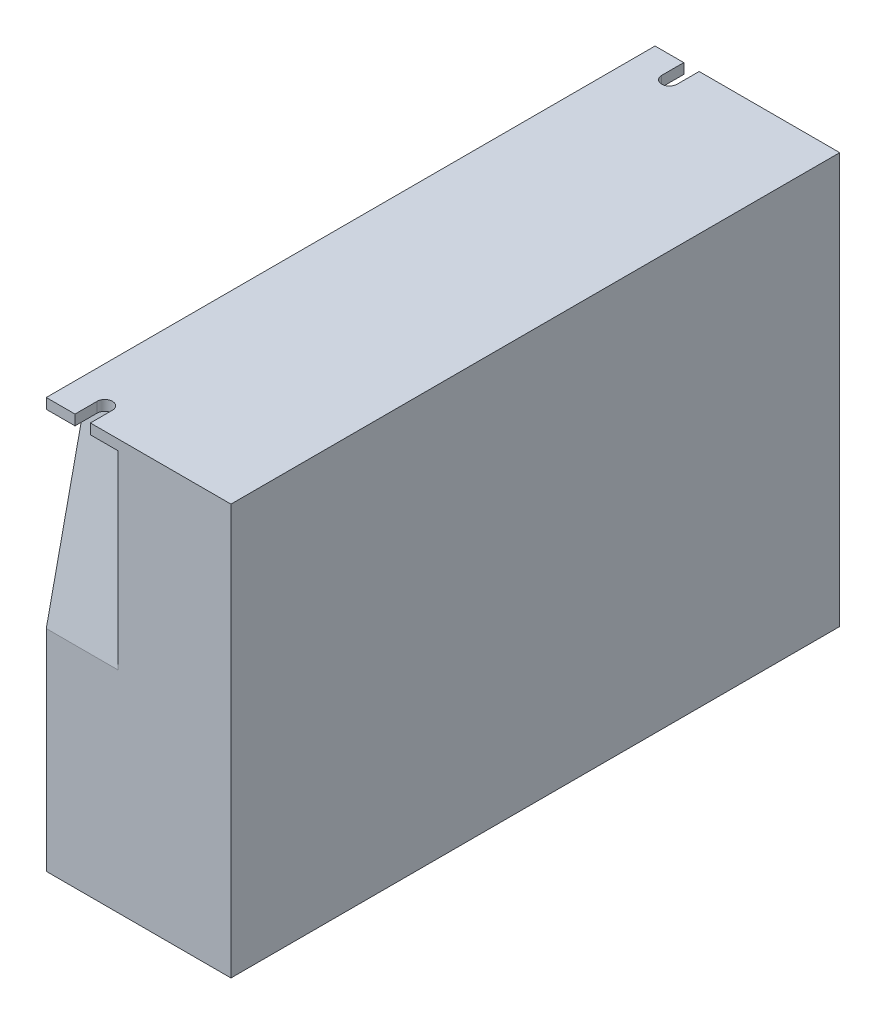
ISO-10303-21;
HEADER;
FILE_DESCRIPTION(('STEP AP214'),'2;1');
FILE_NAME('part.step','',(''),(''),'','','');
FILE_SCHEMA(('AUTOMOTIVE_DESIGN { 1 0 10303 214 1 1 1 1 }'));
ENDSEC;
DATA;
#1=APPLICATION_CONTEXT('core data for automotive mechanical design processes');
#2=APPLICATION_PROTOCOL_DEFINITION('international standard','automotive_design',2000,#1);
#3=PRODUCT_CONTEXT('',#1,'mechanical');
#4=PRODUCT('Part','Part','',(#3));
#5=PRODUCT_RELATED_PRODUCT_CATEGORY('part','',(#4));
#6=PRODUCT_DEFINITION_FORMATION('','',#4);
#7=PRODUCT_DEFINITION_CONTEXT('part definition',#1,'design');
#8=PRODUCT_DEFINITION('design','',#6,#7);
#9=PRODUCT_DEFINITION_SHAPE('','',#8);
#10=(LENGTH_UNIT() NAMED_UNIT(*) SI_UNIT(.MILLI.,.METRE.));
#11=(NAMED_UNIT(*) PLANE_ANGLE_UNIT() SI_UNIT($,.RADIAN.));
#12=(NAMED_UNIT(*) SI_UNIT($,.STERADIAN.) SOLID_ANGLE_UNIT());
#13=UNCERTAINTY_MEASURE_WITH_UNIT(LENGTH_MEASURE(1.E-05),#10,'distance_accuracy_value','');
#14=(GEOMETRIC_REPRESENTATION_CONTEXT(3) GLOBAL_UNCERTAINTY_ASSIGNED_CONTEXT((#13)) GLOBAL_UNIT_ASSIGNED_CONTEXT((#10,
#11,#12)) REPRESENTATION_CONTEXT('',''));
#15=CARTESIAN_POINT('',(0.,0.,0.));
#16=DIRECTION('',(0.,0.,1.));
#17=DIRECTION('',(1.,0.,0.));
#18=AXIS2_PLACEMENT_3D('',#15,#16,#17);
#19=CARTESIAN_POINT('',(54.,-60.,89.));
#20=DIRECTION('',(0.,0.,-1.));
#21=DIRECTION('',(-1.,0.,0.));
#22=AXIS2_PLACEMENT_3D('',#19,#20,#21);
#23=PLANE('',#22);
#24=DIRECTION('',(-1.,0.,0.));
#25=VECTOR('',#24,1.);
#26=CARTESIAN_POINT('',(54.,60.,89.));
#27=LINE('',#26,#25);
#28=CARTESIAN_POINT('',(54.,60.,89.));
#29=VERTEX_POINT('',#28);
#30=CARTESIAN_POINT('',(12.9,60.,89.));
#31=VERTEX_POINT('',#30);
#32=EDGE_CURVE('E289',#29,#31,#27,.T.);
#33=ORIENTED_EDGE('',*,*,#32,.T.);
#34=DIRECTION('',(0.,1.,0.));
#35=VECTOR('',#34,1.);
#36=CARTESIAN_POINT('',(12.9,57.,89.));
#37=LINE('',#36,#35);
#38=CARTESIAN_POINT('',(12.9,57.,89.));
#39=VERTEX_POINT('',#38);
#40=EDGE_CURVE('E191',#39,#31,#37,.T.);
#41=ORIENTED_EDGE('',*,*,#40,.F.);
#42=DIRECTION('',(-1.,0.,0.));
#43=VECTOR('',#42,1.);
#44=CARTESIAN_POINT('',(21.,57.,89.));
#45=LINE('',#44,#43);
#46=CARTESIAN_POINT('',(21.,57.,89.));
#47=VERTEX_POINT('',#46);
#48=EDGE_CURVE('E230',#47,#39,#45,.T.);
#49=ORIENTED_EDGE('',*,*,#48,.F.);
#50=DIRECTION('',(0.,1.,0.));
#51=VECTOR('',#50,1.);
#52=CARTESIAN_POINT('',(21.,57.,89.));
#53=LINE('',#52,#51);
#54=CARTESIAN_POINT('',(21.,1.49999999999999,89.));
#55=VERTEX_POINT('',#54);
#56=EDGE_CURVE('E224',#55,#47,#53,.T.);
#57=ORIENTED_EDGE('',*,*,#56,.F.);
#58=DIRECTION('',(-1.,0.,0.));
#59=VECTOR('',#58,1.);
#60=CARTESIAN_POINT('',(21.,1.49999999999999,89.));
#61=LINE('',#60,#59);
#62=CARTESIAN_POINT('',(0.,1.49999999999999,89.));
#63=VERTEX_POINT('',#62);
#64=EDGE_CURVE('E234',#55,#63,#61,.T.);
#65=ORIENTED_EDGE('',*,*,#64,.T.);
#66=DIRECTION('',(0.,-1.,0.));
#67=VECTOR('',#66,1.);
#68=CARTESIAN_POINT('',(0.,-60.,89.));
#69=LINE('',#68,#67);
#70=CARTESIAN_POINT('',(0.,-60.,89.));
#71=VERTEX_POINT('',#70);
#72=EDGE_CURVE('E279',#63,#71,#69,.T.);
#73=ORIENTED_EDGE('',*,*,#72,.T.);
#74=DIRECTION('',(-1.,0.,0.));
#75=VECTOR('',#74,1.);
#76=CARTESIAN_POINT('',(54.,-60.,89.));
#77=LINE('',#76,#75);
#78=CARTESIAN_POINT('',(54.,-60.,89.));
#79=VERTEX_POINT('',#78);
#80=EDGE_CURVE('E286',#79,#71,#77,.T.);
#81=ORIENTED_EDGE('',*,*,#80,.F.);
#82=DIRECTION('',(0.,-1.,0.));
#83=VECTOR('',#82,1.);
#84=CARTESIAN_POINT('',(54.,-60.,89.));
#85=LINE('',#84,#83);
#86=EDGE_CURVE('E268',#29,#79,#85,.T.);
#87=ORIENTED_EDGE('',*,*,#86,.F.);
#88=EDGE_LOOP('',(#33,#41,#49,#57,#65,#73,#81,#87));
#89=FACE_BOUND('',#88,.T.);
#90=ADVANCED_FACE('F35',(#89),#23,.F.);
#91=CARTESIAN_POINT('',(54.,-60.,-89.));
#92=DIRECTION('',(0.,0.,1.));
#93=DIRECTION('',(1.,0.,0.));
#94=AXIS2_PLACEMENT_3D('',#91,#92,#93);
#95=PLANE('',#94);
#96=DIRECTION('',(-1.,0.,0.));
#97=VECTOR('',#96,1.);
#98=CARTESIAN_POINT('',(54.,60.,-89.));
#99=LINE('',#98,#97);
#100=CARTESIAN_POINT('',(8.4,60.,-89.));
#101=VERTEX_POINT('',#100);
#102=CARTESIAN_POINT('',(0.,60.,-89.));
#103=VERTEX_POINT('',#102);
#104=EDGE_CURVE('E43',#101,#103,#99,.T.);
#105=ORIENTED_EDGE('',*,*,#104,.F.);
#106=DIRECTION('',(0.,1.,0.));
#107=VECTOR('',#106,1.);
#108=CARTESIAN_POINT('',(8.4,57.,-89.));
#109=LINE('',#108,#107);
#110=CARTESIAN_POINT('',(8.4,57.,-89.));
#111=VERTEX_POINT('',#110);
#112=EDGE_CURVE('E213',#111,#101,#109,.T.);
#113=ORIENTED_EDGE('',*,*,#112,.F.);
#114=DIRECTION('',(-1.,0.,0.));
#115=VECTOR('',#114,1.);
#116=CARTESIAN_POINT('',(21.,57.,-89.));
#117=LINE('',#116,#115);
#118=CARTESIAN_POINT('',(0.,57.,-89.));
#119=VERTEX_POINT('',#118);
#120=EDGE_CURVE('E258',#111,#119,#117,.T.);
#121=ORIENTED_EDGE('',*,*,#120,.T.);
#122=DIRECTION('',(0.,1.,0.));
#123=VECTOR('',#122,1.);
#124=CARTESIAN_POINT('',(0.,-60.,-89.));
#125=LINE('',#124,#123);
#126=EDGE_CURVE('E257',#119,#103,#125,.T.);
#127=ORIENTED_EDGE('',*,*,#126,.T.);
#128=EDGE_LOOP('',(#105,#113,#121,#127));
#129=FACE_BOUND('',#128,.T.);
#130=ADVANCED_FACE('F339',(#129),#95,.F.);
#131=CARTESIAN_POINT('',(21.,57.,-89.));
#132=VERTEX_POINT('',#131);
#133=CARTESIAN_POINT('',(12.9,57.,-89.));
#134=VERTEX_POINT('',#133);
#135=EDGE_CURVE('E254',#132,#134,#117,.T.);
#136=ORIENTED_EDGE('',*,*,#135,.T.);
#137=DIRECTION('',(0.,1.,0.));
#138=VECTOR('',#137,1.);
#139=CARTESIAN_POINT('',(12.9,57.,-89.));
#140=LINE('',#139,#138);
#141=CARTESIAN_POINT('',(12.9,60.,-89.));
#142=VERTEX_POINT('',#141);
#143=EDGE_CURVE('E58',#134,#142,#140,.T.);
#144=ORIENTED_EDGE('',*,*,#143,.T.);
#145=CARTESIAN_POINT('',(54.,60.,-89.));
#146=VERTEX_POINT('',#145);
#147=EDGE_CURVE('E11',#146,#142,#99,.T.);
#148=ORIENTED_EDGE('',*,*,#147,.F.);
#149=DIRECTION('',(0.,1.,0.));
#150=VECTOR('',#149,1.);
#151=CARTESIAN_POINT('',(54.,-60.,-89.));
#152=LINE('',#151,#150);
#153=CARTESIAN_POINT('',(54.,-60.,-89.));
#154=VERTEX_POINT('',#153);
#155=EDGE_CURVE('E262',#154,#146,#152,.T.);
#156=ORIENTED_EDGE('',*,*,#155,.F.);
#157=DIRECTION('',(-1.,0.,0.));
#158=VECTOR('',#157,1.);
#159=CARTESIAN_POINT('',(54.,-60.,-89.));
#160=LINE('',#159,#158);
#161=CARTESIAN_POINT('',(0.,-60.,-89.));
#162=VERTEX_POINT('',#161);
#163=EDGE_CURVE('E272',#154,#162,#160,.T.);
#164=ORIENTED_EDGE('',*,*,#163,.T.);
#165=CARTESIAN_POINT('',(0.,1.49999999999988,-89.));
#166=VERTEX_POINT('',#165);
#167=EDGE_CURVE('E273',#162,#166,#125,.T.);
#168=ORIENTED_EDGE('',*,*,#167,.T.);
#169=DIRECTION('',(-1.,0.,0.));
#170=VECTOR('',#169,1.);
#171=CARTESIAN_POINT('',(21.,1.49999999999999,-89.));
#172=LINE('',#171,#170);
#173=CARTESIAN_POINT('',(21.,1.49999999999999,-89.));
#174=VERTEX_POINT('',#173);
#175=EDGE_CURVE('E249',#174,#166,#172,.T.);
#176=ORIENTED_EDGE('',*,*,#175,.F.);
#177=DIRECTION('',(0.,-1.,0.));
#178=VECTOR('',#177,1.);
#179=CARTESIAN_POINT('',(21.,57.,-89.));
#180=LINE('',#179,#178);
#181=EDGE_CURVE('E239',#132,#174,#180,.T.);
#182=ORIENTED_EDGE('',*,*,#181,.F.);
#183=EDGE_LOOP('',(#136,#144,#148,#156,#164,#168,#176,#182));
#184=FACE_BOUND('',#183,.T.);
#185=ADVANCED_FACE('F37',(#184),#95,.F.);
#186=CARTESIAN_POINT('',(54.,60.,89.));
#187=DIRECTION('',(0.,-1.,0.));
#188=DIRECTION('',(0.,0.,-1.));
#189=AXIS2_PLACEMENT_3D('',#186,#187,#188);
#190=PLANE('',#189);
#191=CARTESIAN_POINT('',(10.65,60.,82.55));
#192=DIRECTION('',(0.,1.,0.));
#193=DIRECTION('',(0.,0.,1.));
#194=AXIS2_PLACEMENT_3D('',#191,#192,#193);
#195=CIRCLE('',#194,2.25);
#196=CARTESIAN_POINT('',(12.9,60.,82.55));
#197=VERTEX_POINT('',#196);
#198=CARTESIAN_POINT('',(8.4,60.,82.55));
#199=VERTEX_POINT('',#198);
#200=EDGE_CURVE('E168',#197,#199,#195,.T.);
#201=ORIENTED_EDGE('',*,*,#200,.F.);
#202=DIRECTION('',(0.,0.,-1.));
#203=VECTOR('',#202,1.);
#204=CARTESIAN_POINT('',(12.9,60.,89.));
#205=LINE('',#204,#203);
#206=EDGE_CURVE('E179',#31,#197,#205,.T.);
#207=ORIENTED_EDGE('',*,*,#206,.F.);
#208=ORIENTED_EDGE('',*,*,#32,.F.);
#209=DIRECTION('',(0.,0.,1.));
#210=VECTOR('',#209,1.);
#211=CARTESIAN_POINT('',(54.,60.,89.));
#212=LINE('',#211,#210);
#213=EDGE_CURVE('E265',#146,#29,#212,.T.);
#214=ORIENTED_EDGE('',*,*,#213,.F.);
#215=ORIENTED_EDGE('',*,*,#147,.T.);
#216=DIRECTION('',(0.,0.,-1.));
#217=VECTOR('',#216,1.);
#218=CARTESIAN_POINT('',(12.9,60.,-89.));
#219=LINE('',#218,#217);
#220=CARTESIAN_POINT('',(12.9,60.,-82.55));
#221=VERTEX_POINT('',#220);
#222=EDGE_CURVE('E206',#221,#142,#219,.T.);
#223=ORIENTED_EDGE('',*,*,#222,.F.);
#224=CARTESIAN_POINT('',(10.65,60.,-82.55));
#225=DIRECTION('',(0.,1.,0.));
#226=DIRECTION('',(0.,0.,1.));
#227=AXIS2_PLACEMENT_3D('',#224,#225,#226);
#228=CIRCLE('',#227,2.25);
#229=CARTESIAN_POINT('',(8.4,60.,-82.55));
#230=VERTEX_POINT('',#229);
#231=EDGE_CURVE('E190',#230,#221,#228,.T.);
#232=ORIENTED_EDGE('',*,*,#231,.F.);
#233=DIRECTION('',(0.,0.,1.));
#234=VECTOR('',#233,1.);
#235=CARTESIAN_POINT('',(8.4,60.,-82.55));
#236=LINE('',#235,#234);
#237=EDGE_CURVE('E198',#101,#230,#236,.T.);
#238=ORIENTED_EDGE('',*,*,#237,.F.);
#239=ORIENTED_EDGE('',*,*,#104,.T.);
#240=DIRECTION('',(0.,0.,1.));
#241=VECTOR('',#240,1.);
#242=CARTESIAN_POINT('',(0.,60.,89.));
#243=LINE('',#242,#241);
#244=CARTESIAN_POINT('',(0.,60.,89.));
#245=VERTEX_POINT('',#244);
#246=EDGE_CURVE('E276',#103,#245,#243,.T.);
#247=ORIENTED_EDGE('',*,*,#246,.T.);
#248=CARTESIAN_POINT('',(8.4,60.,89.));
#249=VERTEX_POINT('',#248);
#250=EDGE_CURVE('E288',#249,#245,#27,.T.);
#251=ORIENTED_EDGE('',*,*,#250,.F.);
#252=DIRECTION('',(0.,0.,1.));
#253=VECTOR('',#252,1.);
#254=CARTESIAN_POINT('',(8.4,60.,82.55));
#255=LINE('',#254,#253);
#256=EDGE_CURVE('E182',#199,#249,#255,.T.);
#257=ORIENTED_EDGE('',*,*,#256,.F.);
#258=EDGE_LOOP('',(#201,#207,#208,#214,#215,#223,#232,#238,#239,#247,#251,#257));
#259=FACE_BOUND('',#258,.T.);
#260=ADVANCED_FACE('F301',(#259),#190,.F.);
#261=CARTESIAN_POINT('',(8.4,57.,89.));
#262=VERTEX_POINT('',#261);
#263=CARTESIAN_POINT('',(0.,57.,89.));
#264=VERTEX_POINT('',#263);
#265=EDGE_CURVE('E233',#262,#264,#45,.T.);
#266=ORIENTED_EDGE('',*,*,#265,.F.);
#267=DIRECTION('',(0.,1.,0.));
#268=VECTOR('',#267,1.);
#269=CARTESIAN_POINT('',(8.4,57.,89.));
#270=LINE('',#269,#268);
#271=EDGE_CURVE('E50',#262,#249,#270,.T.);
#272=ORIENTED_EDGE('',*,*,#271,.T.);
#273=ORIENTED_EDGE('',*,*,#250,.T.);
#274=EDGE_CURVE('E280',#245,#264,#69,.T.);
#275=ORIENTED_EDGE('',*,*,#274,.T.);
#276=EDGE_LOOP('',(#266,#272,#273,#275));
#277=FACE_BOUND('',#276,.T.);
#278=ADVANCED_FACE('F297',(#277),#23,.F.);
#279=CARTESIAN_POINT('',(54.,-60.,89.));
#280=DIRECTION('',(0.,1.,0.));
#281=DIRECTION('',(0.,0.,1.));
#282=AXIS2_PLACEMENT_3D('',#279,#280,#281);
#283=PLANE('',#282);
#284=DIRECTION('',(0.,0.,-1.));
#285=VECTOR('',#284,1.);
#286=CARTESIAN_POINT('',(0.,-60.,89.));
#287=LINE('',#286,#285);
#288=EDGE_CURVE('E266',#71,#162,#287,.T.);
#289=ORIENTED_EDGE('',*,*,#288,.T.);
#290=ORIENTED_EDGE('',*,*,#163,.F.);
#291=DIRECTION('',(0.,0.,-1.));
#292=VECTOR('',#291,1.);
#293=CARTESIAN_POINT('',(54.,-60.,89.));
#294=LINE('',#293,#292);
#295=EDGE_CURVE('E270',#79,#154,#294,.T.);
#296=ORIENTED_EDGE('',*,*,#295,.F.);
#297=ORIENTED_EDGE('',*,*,#80,.T.);
#298=EDGE_LOOP('',(#289,#290,#296,#297));
#299=FACE_BOUND('',#298,.T.);
#300=ADVANCED_FACE('F353',(#299),#283,.F.);
#301=CARTESIAN_POINT('',(54.,0.,0.));
#302=DIRECTION('',(-1.,0.,0.));
#303=DIRECTION('',(0.,0.,1.));
#304=AXIS2_PLACEMENT_3D('',#301,#302,#303);
#305=PLANE('',#304);
#306=ORIENTED_EDGE('',*,*,#155,.T.);
#307=ORIENTED_EDGE('',*,*,#213,.T.);
#308=ORIENTED_EDGE('',*,*,#86,.T.);
#309=ORIENTED_EDGE('',*,*,#295,.T.);
#310=EDGE_LOOP('',(#306,#307,#308,#309));
#311=FACE_BOUND('',#310,.T.);
#312=ADVANCED_FACE('F324',(#311),#305,.F.);
#313=CARTESIAN_POINT('',(0.,0.,0.));
#314=DIRECTION('',(-1.,0.,0.));
#315=DIRECTION('',(0.,0.,1.));
#316=AXIS2_PLACEMENT_3D('',#313,#314,#315);
#317=PLANE('',#316);
#318=DIRECTION('',(0.,0.,-1.));
#319=VECTOR('',#318,1.);
#320=CARTESIAN_POINT('',(0.,57.,89.));
#321=LINE('',#320,#319);
#322=CARTESIAN_POINT('',(0.,57.,77.));
#323=VERTEX_POINT('',#322);
#324=EDGE_CURVE('E212',#264,#323,#321,.T.);
#325=ORIENTED_EDGE('',*,*,#324,.F.);
#326=ORIENTED_EDGE('',*,*,#274,.F.);
#327=ORIENTED_EDGE('',*,*,#246,.F.);
#328=ORIENTED_EDGE('',*,*,#126,.F.);
#329=DIRECTION('',(0.,0.,-1.));
#330=VECTOR('',#329,1.);
#331=CARTESIAN_POINT('',(0.,57.,-89.));
#332=LINE('',#331,#330);
#333=CARTESIAN_POINT('',(0.,57.,-77.));
#334=VERTEX_POINT('',#333);
#335=EDGE_CURVE('E243',#334,#119,#332,.T.);
#336=ORIENTED_EDGE('',*,*,#335,.F.);
#337=DIRECTION('',(0.,0.977414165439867,0.211332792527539));
#338=VECTOR('',#337,1.);
#339=CARTESIAN_POINT('',(0.,57.,-77.));
#340=LINE('',#339,#338);
#341=EDGE_CURVE('E232',#166,#334,#340,.T.);
#342=ORIENTED_EDGE('',*,*,#341,.F.);
#343=ORIENTED_EDGE('',*,*,#167,.F.);
#344=ORIENTED_EDGE('',*,*,#288,.F.);
#345=ORIENTED_EDGE('',*,*,#72,.F.);
#346=DIRECTION('',(0.,-0.977414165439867,0.211332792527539));
#347=VECTOR('',#346,1.);
#348=CARTESIAN_POINT('',(0.,57.,77.));
#349=LINE('',#348,#347);
#350=EDGE_CURVE('E221',#323,#63,#349,.T.);
#351=ORIENTED_EDGE('',*,*,#350,.F.);
#352=EDGE_LOOP('',(#325,#326,#327,#328,#336,#342,#343,#344,#345,#351));
#353=FACE_BOUND('',#352,.T.);
#354=ADVANCED_FACE('F308',(#353),#317,.T.);
#355=CARTESIAN_POINT('',(21.,57.,-89.));
#356=DIRECTION('',(0.,1.,0.));
#357=DIRECTION('',(0.,0.,1.));
#358=AXIS2_PLACEMENT_3D('',#355,#356,#357);
#359=PLANE('',#358);
#360=ORIENTED_EDGE('',*,*,#120,.F.);
#361=DIRECTION('',(0.,0.,1.));
#362=VECTOR('',#361,1.);
#363=CARTESIAN_POINT('',(8.4,57.,-82.55));
#364=LINE('',#363,#362);
#365=CARTESIAN_POINT('',(8.4,57.,-82.55));
#366=VERTEX_POINT('',#365);
#367=EDGE_CURVE('E200',#111,#366,#364,.T.);
#368=ORIENTED_EDGE('',*,*,#367,.T.);
#369=CARTESIAN_POINT('',(10.65,57.,-82.55));
#370=DIRECTION('',(0.,1.,0.));
#371=DIRECTION('',(0.,0.,1.));
#372=AXIS2_PLACEMENT_3D('',#369,#370,#371);
#373=CIRCLE('',#372,2.25);
#374=CARTESIAN_POINT('',(12.9,57.,-82.55));
#375=VERTEX_POINT('',#374);
#376=EDGE_CURVE('E194',#366,#375,#373,.T.);
#377=ORIENTED_EDGE('',*,*,#376,.T.);
#378=DIRECTION('',(0.,0.,-1.));
#379=VECTOR('',#378,1.);
#380=CARTESIAN_POINT('',(12.9,57.,-89.));
#381=LINE('',#380,#379);
#382=EDGE_CURVE('E197',#375,#134,#381,.T.);
#383=ORIENTED_EDGE('',*,*,#382,.T.);
#384=ORIENTED_EDGE('',*,*,#135,.F.);
#385=DIRECTION('',(0.,0.,-1.));
#386=VECTOR('',#385,1.);
#387=CARTESIAN_POINT('',(21.,57.,-89.));
#388=LINE('',#387,#386);
#389=CARTESIAN_POINT('',(21.,57.,-77.));
#390=VERTEX_POINT('',#389);
#391=EDGE_CURVE('E246',#390,#132,#388,.T.);
#392=ORIENTED_EDGE('',*,*,#391,.F.);
#393=DIRECTION('',(-1.,0.,0.));
#394=VECTOR('',#393,1.);
#395=CARTESIAN_POINT('',(21.,57.,-77.));
#396=LINE('',#395,#394);
#397=EDGE_CURVE('E259',#390,#334,#396,.T.);
#398=ORIENTED_EDGE('',*,*,#397,.T.);
#399=ORIENTED_EDGE('',*,*,#335,.T.);
#400=EDGE_LOOP('',(#360,#368,#377,#383,#384,#392,#398,#399));
#401=FACE_BOUND('',#400,.T.);
#402=ADVANCED_FACE('F345',(#401),#359,.F.);
#403=CARTESIAN_POINT('',(21.,57.,-77.));
#404=DIRECTION('',(0.,-0.211332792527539,0.977414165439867));
#405=DIRECTION('',(0.,-0.977414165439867,-0.211332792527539));
#406=AXIS2_PLACEMENT_3D('',#403,#404,#405);
#407=PLANE('',#406);
#408=ORIENTED_EDGE('',*,*,#341,.T.);
#409=ORIENTED_EDGE('',*,*,#397,.F.);
#410=DIRECTION('',(0.,0.977414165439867,0.211332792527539));
#411=VECTOR('',#410,1.);
#412=CARTESIAN_POINT('',(21.,57.,-77.));
#413=LINE('',#412,#411);
#414=EDGE_CURVE('E242',#174,#390,#413,.T.);
#415=ORIENTED_EDGE('',*,*,#414,.F.);
#416=ORIENTED_EDGE('',*,*,#175,.T.);
#417=EDGE_LOOP('',(#408,#409,#415,#416));
#418=FACE_BOUND('',#417,.T.);
#419=ADVANCED_FACE('F348',(#418),#407,.F.);
#420=CARTESIAN_POINT('',(21.,0.,0.));
#421=DIRECTION('',(-1.,0.,0.));
#422=DIRECTION('',(0.,0.,1.));
#423=AXIS2_PLACEMENT_3D('',#420,#421,#422);
#424=PLANE('',#423);
#425=ORIENTED_EDGE('',*,*,#181,.T.);
#426=ORIENTED_EDGE('',*,*,#414,.T.);
#427=ORIENTED_EDGE('',*,*,#391,.T.);
#428=EDGE_LOOP('',(#425,#426,#427));
#429=FACE_BOUND('',#428,.T.);
#430=ADVANCED_FACE('F406',(#429),#424,.T.);
#431=CARTESIAN_POINT('',(21.,57.,89.));
#432=DIRECTION('',(0.,1.,0.));
#433=DIRECTION('',(0.,0.,1.));
#434=AXIS2_PLACEMENT_3D('',#431,#432,#433);
#435=PLANE('',#434);
#436=ORIENTED_EDGE('',*,*,#48,.T.);
#437=DIRECTION('',(0.,0.,-1.));
#438=VECTOR('',#437,1.);
#439=CARTESIAN_POINT('',(12.9,57.,89.));
#440=LINE('',#439,#438);
#441=CARTESIAN_POINT('',(12.9,57.,82.55));
#442=VERTEX_POINT('',#441);
#443=EDGE_CURVE('E170',#39,#442,#440,.T.);
#444=ORIENTED_EDGE('',*,*,#443,.T.);
#445=CARTESIAN_POINT('',(10.65,57.,82.55));
#446=DIRECTION('',(0.,1.,0.));
#447=DIRECTION('',(0.,0.,1.));
#448=AXIS2_PLACEMENT_3D('',#445,#446,#447);
#449=CIRCLE('',#448,2.25);
#450=CARTESIAN_POINT('',(8.4,57.,82.55));
#451=VERTEX_POINT('',#450);
#452=EDGE_CURVE('E165',#442,#451,#449,.T.);
#453=ORIENTED_EDGE('',*,*,#452,.T.);
#454=DIRECTION('',(0.,0.,1.));
#455=VECTOR('',#454,1.);
#456=CARTESIAN_POINT('',(8.4,57.,82.55));
#457=LINE('',#456,#455);
#458=EDGE_CURVE('E172',#451,#262,#457,.T.);
#459=ORIENTED_EDGE('',*,*,#458,.T.);
#460=ORIENTED_EDGE('',*,*,#265,.T.);
#461=ORIENTED_EDGE('',*,*,#324,.T.);
#462=DIRECTION('',(-1.,0.,0.));
#463=VECTOR('',#462,1.);
#464=CARTESIAN_POINT('',(21.,57.,77.));
#465=LINE('',#464,#463);
#466=CARTESIAN_POINT('',(21.,57.,77.));
#467=VERTEX_POINT('',#466);
#468=EDGE_CURVE('E227',#467,#323,#465,.T.);
#469=ORIENTED_EDGE('',*,*,#468,.F.);
#470=DIRECTION('',(0.,0.,-1.));
#471=VECTOR('',#470,1.);
#472=CARTESIAN_POINT('',(21.,57.,89.));
#473=LINE('',#472,#471);
#474=EDGE_CURVE('E217',#47,#467,#473,.T.);
#475=ORIENTED_EDGE('',*,*,#474,.F.);
#476=EDGE_LOOP('',(#436,#444,#453,#459,#460,#461,#469,#475));
#477=FACE_BOUND('',#476,.T.);
#478=ADVANCED_FACE('F178',(#477),#435,.F.);
#479=CARTESIAN_POINT('',(21.,57.,77.));
#480=DIRECTION('',(0.,-0.211332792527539,-0.977414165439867));
#481=DIRECTION('',(0.,0.977414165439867,-0.211332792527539));
#482=AXIS2_PLACEMENT_3D('',#479,#480,#481);
#483=PLANE('',#482);
#484=ORIENTED_EDGE('',*,*,#350,.T.);
#485=ORIENTED_EDGE('',*,*,#64,.F.);
#486=DIRECTION('',(0.,-0.977414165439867,0.211332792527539));
#487=VECTOR('',#486,1.);
#488=CARTESIAN_POINT('',(21.,57.,77.));
#489=LINE('',#488,#487);
#490=EDGE_CURVE('E220',#467,#55,#489,.T.);
#491=ORIENTED_EDGE('',*,*,#490,.F.);
#492=ORIENTED_EDGE('',*,*,#468,.T.);
#493=EDGE_LOOP('',(#484,#485,#491,#492));
#494=FACE_BOUND('',#493,.T.);
#495=ADVANCED_FACE('F313',(#494),#483,.F.);
#496=CARTESIAN_POINT('',(21.,0.,0.));
#497=DIRECTION('',(-1.,0.,0.));
#498=DIRECTION('',(0.,0.,1.));
#499=AXIS2_PLACEMENT_3D('',#496,#497,#498);
#500=PLANE('',#499);
#501=ORIENTED_EDGE('',*,*,#474,.T.);
#502=ORIENTED_EDGE('',*,*,#490,.T.);
#503=ORIENTED_EDGE('',*,*,#56,.T.);
#504=EDGE_LOOP('',(#501,#502,#503));
#505=FACE_BOUND('',#504,.T.);
#506=ADVANCED_FACE('F316',(#505),#500,.T.);
#507=CARTESIAN_POINT('',(10.65,57.,-82.55));
#508=DIRECTION('',(0.,1.,0.));
#509=DIRECTION('',(0.,0.,1.));
#510=AXIS2_PLACEMENT_3D('',#507,#508,#509);
#511=CYLINDRICAL_SURFACE('',#510,2.25);
#512=ORIENTED_EDGE('',*,*,#231,.T.);
#513=DIRECTION('',(0.,1.,0.));
#514=VECTOR('',#513,1.);
#515=CARTESIAN_POINT('',(12.9,57.,-82.55));
#516=LINE('',#515,#514);
#517=EDGE_CURVE('E203',#375,#221,#516,.T.);
#518=ORIENTED_EDGE('',*,*,#517,.F.);
#519=ORIENTED_EDGE('',*,*,#376,.F.);
#520=DIRECTION('',(0.,1.,0.));
#521=VECTOR('',#520,1.);
#522=CARTESIAN_POINT('',(8.4,57.,-82.55));
#523=LINE('',#522,#521);
#524=EDGE_CURVE('E210',#366,#230,#523,.T.);
#525=ORIENTED_EDGE('',*,*,#524,.T.);
#526=EDGE_LOOP('',(#512,#518,#519,#525));
#527=FACE_BOUND('',#526,.T.);
#528=ADVANCED_FACE('F334',(#527),#511,.F.);
#529=CARTESIAN_POINT('',(8.4,57.,-82.55));
#530=DIRECTION('',(-1.,0.,0.));
#531=DIRECTION('',(0.,0.,1.));
#532=AXIS2_PLACEMENT_3D('',#529,#530,#531);
#533=PLANE('',#532);
#534=ORIENTED_EDGE('',*,*,#237,.T.);
#535=ORIENTED_EDGE('',*,*,#524,.F.);
#536=ORIENTED_EDGE('',*,*,#367,.F.);
#537=ORIENTED_EDGE('',*,*,#112,.T.);
#538=EDGE_LOOP('',(#534,#535,#536,#537));
#539=FACE_BOUND('',#538,.T.);
#540=ADVANCED_FACE('F336',(#539),#533,.F.);
#541=CARTESIAN_POINT('',(12.9,57.,-89.));
#542=DIRECTION('',(1.,0.,0.));
#543=DIRECTION('',(0.,0.,-1.));
#544=AXIS2_PLACEMENT_3D('',#541,#542,#543);
#545=PLANE('',#544);
#546=ORIENTED_EDGE('',*,*,#222,.T.);
#547=ORIENTED_EDGE('',*,*,#143,.F.);
#548=ORIENTED_EDGE('',*,*,#382,.F.);
#549=ORIENTED_EDGE('',*,*,#517,.T.);
#550=EDGE_LOOP('',(#546,#547,#548,#549));
#551=FACE_BOUND('',#550,.T.);
#552=ADVANCED_FACE('F331',(#551),#545,.F.);
#553=CARTESIAN_POINT('',(10.65,57.,82.55));
#554=DIRECTION('',(0.,1.,0.));
#555=DIRECTION('',(0.,0.,1.));
#556=AXIS2_PLACEMENT_3D('',#553,#554,#555);
#557=CYLINDRICAL_SURFACE('',#556,2.25);
#558=ORIENTED_EDGE('',*,*,#200,.T.);
#559=DIRECTION('',(0.,1.,0.));
#560=VECTOR('',#559,1.);
#561=CARTESIAN_POINT('',(8.4,57.,82.55));
#562=LINE('',#561,#560);
#563=EDGE_CURVE('E162',#451,#199,#562,.T.);
#564=ORIENTED_EDGE('',*,*,#563,.F.);
#565=ORIENTED_EDGE('',*,*,#452,.F.);
#566=DIRECTION('',(0.,1.,0.));
#567=VECTOR('',#566,1.);
#568=CARTESIAN_POINT('',(12.9,57.,82.55));
#569=LINE('',#568,#567);
#570=EDGE_CURVE('E188',#442,#197,#569,.T.);
#571=ORIENTED_EDGE('',*,*,#570,.T.);
#572=EDGE_LOOP('',(#558,#564,#565,#571));
#573=FACE_BOUND('',#572,.T.);
#574=ADVANCED_FACE('F163',(#573),#557,.F.);
#575=CARTESIAN_POINT('',(12.9,57.,89.));
#576=DIRECTION('',(1.,0.,0.));
#577=DIRECTION('',(0.,0.,-1.));
#578=AXIS2_PLACEMENT_3D('',#575,#576,#577);
#579=PLANE('',#578);
#580=ORIENTED_EDGE('',*,*,#206,.T.);
#581=ORIENTED_EDGE('',*,*,#570,.F.);
#582=ORIENTED_EDGE('',*,*,#443,.F.);
#583=ORIENTED_EDGE('',*,*,#40,.T.);
#584=EDGE_LOOP('',(#580,#581,#582,#583));
#585=FACE_BOUND('',#584,.T.);
#586=ADVANCED_FACE('F320',(#585),#579,.F.);
#587=CARTESIAN_POINT('',(8.4,57.,82.55));
#588=DIRECTION('',(-1.,0.,0.));
#589=DIRECTION('',(0.,0.,1.));
#590=AXIS2_PLACEMENT_3D('',#587,#588,#589);
#591=PLANE('',#590);
#592=ORIENTED_EDGE('',*,*,#256,.T.);
#593=ORIENTED_EDGE('',*,*,#271,.F.);
#594=ORIENTED_EDGE('',*,*,#458,.F.);
#595=ORIENTED_EDGE('',*,*,#563,.T.);
#596=EDGE_LOOP('',(#592,#593,#594,#595));
#597=FACE_BOUND('',#596,.T.);
#598=ADVANCED_FACE('F173',(#597),#591,.F.);
#599=CLOSED_SHELL('',(#90,#130,#185,#260,#278,#300,#312,#354,#402,#419,#430,#478,#495,#506,#528,
#540,#552,#574,#586,#598));
#600=MANIFOLD_SOLID_BREP('B2',#599);
#601=ADVANCED_BREP_SHAPE_REPRESENTATION('',(#18,#600),#14);
#602=SHAPE_DEFINITION_REPRESENTATION(#9,#601);
ENDSEC;
END-ISO-10303-21;
